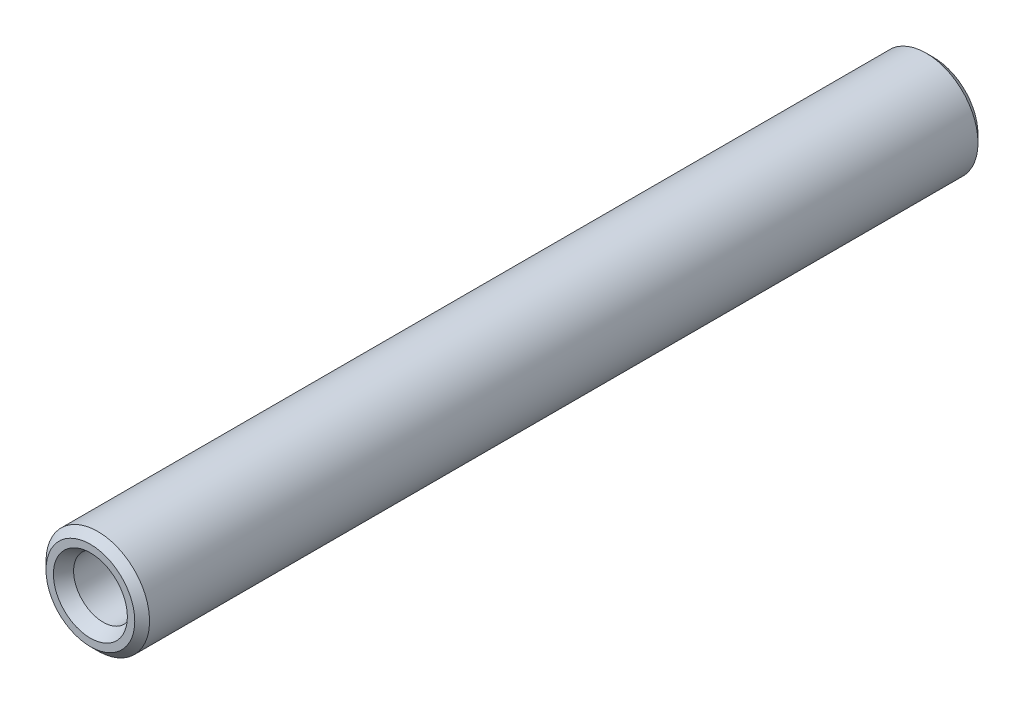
ISO-10303-21;
HEADER;
FILE_DESCRIPTION(('STEP AP214'),'2;1');
FILE_NAME('part.step','',(''),(''),'','','');
FILE_SCHEMA(('AUTOMOTIVE_DESIGN { 1 0 10303 214 1 1 1 1 }'));
ENDSEC;
DATA;
#1=APPLICATION_CONTEXT('core data for automotive mechanical design processes');
#2=APPLICATION_PROTOCOL_DEFINITION('international standard','automotive_design',2000,#1);
#3=PRODUCT_CONTEXT('',#1,'mechanical');
#4=PRODUCT('Part','Part','',(#3));
#5=PRODUCT_RELATED_PRODUCT_CATEGORY('part','',(#4));
#6=PRODUCT_DEFINITION_FORMATION('','',#4);
#7=PRODUCT_DEFINITION_CONTEXT('part definition',#1,'design');
#8=PRODUCT_DEFINITION('design','',#6,#7);
#9=PRODUCT_DEFINITION_SHAPE('','',#8);
#10=(LENGTH_UNIT() NAMED_UNIT(*) SI_UNIT(.MILLI.,.METRE.));
#11=(NAMED_UNIT(*) PLANE_ANGLE_UNIT() SI_UNIT($,.RADIAN.));
#12=(NAMED_UNIT(*) SI_UNIT($,.STERADIAN.) SOLID_ANGLE_UNIT());
#13=UNCERTAINTY_MEASURE_WITH_UNIT(LENGTH_MEASURE(1.E-05),#10,'distance_accuracy_value','');
#14=(GEOMETRIC_REPRESENTATION_CONTEXT(3) GLOBAL_UNCERTAINTY_ASSIGNED_CONTEXT((#13)) GLOBAL_UNIT_ASSIGNED_CONTEXT((#10,
#11,#12)) REPRESENTATION_CONTEXT('',''));
#15=CARTESIAN_POINT('',(0.,0.,0.));
#16=DIRECTION('',(0.,0.,1.));
#17=DIRECTION('',(1.,0.,0.));
#18=AXIS2_PLACEMENT_3D('',#15,#16,#17);
#19=CARTESIAN_POINT('',(0.,0.,114.));
#20=DIRECTION('',(0.,0.,-1.));
#21=DIRECTION('',(-1.,0.,0.));
#22=AXIS2_PLACEMENT_3D('',#19,#20,#21);
#23=CYLINDRICAL_SURFACE('',#22,7.);
#24=CARTESIAN_POINT('',(0.,0.,1.00000000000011));
#25=DIRECTION('',(0.,0.,1.));
#26=DIRECTION('',(1.,0.,0.));
#27=AXIS2_PLACEMENT_3D('',#24,#25,#26);
#28=CIRCLE('',#27,7.);
#29=CARTESIAN_POINT('',(-7.,0.,1.00000000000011));
#30=VERTEX_POINT('',#29);
#31=EDGE_CURVE('E74',#30,#30,#28,.T.);
#32=CARTESIAN_POINT('',(0.,0.,113.));
#33=DIRECTION('',(0.,0.,1.));
#34=DIRECTION('',(1.,0.,0.));
#35=AXIS2_PLACEMENT_3D('',#32,#33,#34);
#36=CIRCLE('',#35,7.);
#37=CARTESIAN_POINT('',(-7.,0.,113.));
#38=VERTEX_POINT('',#37);
#39=EDGE_CURVE('E78',#38,#38,#36,.F.);
#40=CARTESIAN_POINT('',(-7.,0.,1.00000000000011));
#41=CARTESIAN_POINT('',(-7.,0.,2.16666666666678));
#42=CARTESIAN_POINT('',(-7.,0.,3.33333333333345));
#43=CARTESIAN_POINT('',(-7.,0.,5.66666666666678));
#44=CARTESIAN_POINT('',(-7.,0.,6.83333333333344));
#45=CARTESIAN_POINT('',(-7.,0.,9.16666666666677));
#46=CARTESIAN_POINT('',(-7.,0.,10.3333333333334));
#47=CARTESIAN_POINT('',(-7.,0.,12.6666666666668));
#48=CARTESIAN_POINT('',(-7.,0.,13.8333333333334));
#49=CARTESIAN_POINT('',(-7.,0.,16.1666666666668));
#50=CARTESIAN_POINT('',(-7.,0.,17.3333333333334));
#51=CARTESIAN_POINT('',(-7.,0.,19.6666666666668));
#52=CARTESIAN_POINT('',(-7.,0.,20.8333333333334));
#53=CARTESIAN_POINT('',(-7.,0.,23.1666666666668));
#54=CARTESIAN_POINT('',(-7.,0.,24.3333333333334));
#55=CARTESIAN_POINT('',(-7.,0.,26.6666666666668));
#56=CARTESIAN_POINT('',(-7.,0.,27.8333333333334));
#57=CARTESIAN_POINT('',(-7.,0.,30.1666666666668));
#58=CARTESIAN_POINT('',(-7.,0.,31.3333333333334));
#59=CARTESIAN_POINT('',(-7.,0.,33.6666666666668));
#60=CARTESIAN_POINT('',(-7.,0.,34.8333333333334));
#61=CARTESIAN_POINT('',(-7.,0.,37.1666666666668));
#62=CARTESIAN_POINT('',(-7.,0.,38.3333333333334));
#63=CARTESIAN_POINT('',(-7.,0.,40.6666666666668));
#64=CARTESIAN_POINT('',(-7.,0.,41.8333333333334));
#65=CARTESIAN_POINT('',(-7.,0.,44.1666666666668));
#66=CARTESIAN_POINT('',(-7.,0.,45.3333333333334));
#67=CARTESIAN_POINT('',(-7.,0.,47.6666666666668));
#68=CARTESIAN_POINT('',(-7.,0.,48.8333333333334));
#69=CARTESIAN_POINT('',(-7.,0.,51.1666666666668));
#70=CARTESIAN_POINT('',(-7.,0.,52.3333333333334));
#71=CARTESIAN_POINT('',(-7.,0.,54.6666666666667));
#72=CARTESIAN_POINT('',(-7.,0.,55.8333333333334));
#73=CARTESIAN_POINT('',(-7.,0.,58.1666666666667));
#74=CARTESIAN_POINT('',(-7.,0.,59.3333333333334));
#75=CARTESIAN_POINT('',(-7.,0.,61.6666666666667));
#76=CARTESIAN_POINT('',(-7.,0.,62.8333333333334));
#77=CARTESIAN_POINT('',(-7.,0.,65.1666666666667));
#78=CARTESIAN_POINT('',(-7.,0.,66.3333333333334));
#79=CARTESIAN_POINT('',(-7.,0.,68.6666666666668));
#80=CARTESIAN_POINT('',(-7.,0.,69.8333333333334));
#81=CARTESIAN_POINT('',(-7.,0.,72.1666666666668));
#82=CARTESIAN_POINT('',(-7.,0.,73.3333333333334));
#83=CARTESIAN_POINT('',(-7.,0.,75.6666666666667));
#84=CARTESIAN_POINT('',(-7.,0.,76.8333333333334));
#85=CARTESIAN_POINT('',(-7.,0.,79.1666666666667));
#86=CARTESIAN_POINT('',(-7.,0.,80.3333333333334));
#87=CARTESIAN_POINT('',(-7.,0.,82.6666666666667));
#88=CARTESIAN_POINT('',(-7.,0.,83.8333333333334));
#89=CARTESIAN_POINT('',(-7.,0.,86.1666666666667));
#90=CARTESIAN_POINT('',(-7.,0.,87.3333333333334));
#91=CARTESIAN_POINT('',(-7.,0.,89.6666666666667));
#92=CARTESIAN_POINT('',(-7.,0.,90.8333333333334));
#93=CARTESIAN_POINT('',(-7.,0.,93.1666666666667));
#94=CARTESIAN_POINT('',(-7.,0.,94.3333333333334));
#95=CARTESIAN_POINT('',(-7.,0.,96.6666666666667));
#96=CARTESIAN_POINT('',(-7.,0.,97.8333333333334));
#97=CARTESIAN_POINT('',(-7.,0.,100.166666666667));
#98=CARTESIAN_POINT('',(-7.,0.,101.333333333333));
#99=CARTESIAN_POINT('',(-7.,0.,103.666666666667));
#100=CARTESIAN_POINT('',(-7.,0.,104.833333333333));
#101=CARTESIAN_POINT('',(-7.,0.,107.166666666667));
#102=CARTESIAN_POINT('',(-7.,0.,108.333333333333));
#103=CARTESIAN_POINT('',(-7.,0.,110.666666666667));
#104=CARTESIAN_POINT('',(-7.,0.,111.833333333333));
#105=CARTESIAN_POINT('',(-7.,0.,113.));
#106=B_SPLINE_CURVE_WITH_KNOTS('',3,(#40,#41,#42,#43,#44,#45,#46,#47,#48,#49,#50,#51,#52,#53,
#54,#55,#56,#57,#58,#59,#60,#61,#62,#63,#64,#65,#66,#67,#68,#69,#70,#71,#72,#73,#74,#75,#76,#77,
#78,#79,#80,#81,#82,#83,#84,#85,#86,#87,#88,#89,#90,#91,#92,#93,#94,#95,#96,#97,#98,#99,#100,
#101,#102,#103,#104,#105),.UNSPECIFIED.,.F.,.F.,(4,2,2,2,2,2,2,2,2,2,2,2,2,2,2,2,2,2,2,2,2,2,2,
2,2,2,2,2,2,2,2,2,4),(0.,3.5,6.99999999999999,10.5,14.,17.5,21.,24.5,28.,31.5,35.,38.5,42.,45.5,
49.,52.5,56.,59.5,63.,66.5,70.,73.5,77.,80.5,83.9999999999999,87.5,91.,94.5,97.9999999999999,
101.5,105.,108.5,112.),.UNSPECIFIED.);
#107=EDGE_CURVE('BSEAM41',#30,#38,#106,.T.);
#108=ORIENTED_EDGE('',*,*,#31,.T.);
#109=ORIENTED_EDGE('',*,*,#39,.T.);
#110=ORIENTED_EDGE('',*,*,#107,.T.);
#111=ORIENTED_EDGE('',*,*,#107,.F.);
#112=EDGE_LOOP('',(#108,#110,#109,#111));
#113=FACE_BOUND('',#112,.T.);
#114=ADVANCED_FACE('F41',(#113),#23,.T.);
#115=CARTESIAN_POINT('',(0.,0.,114.));
#116=DIRECTION('',(0.,0.,1.));
#117=DIRECTION('',(1.,0.,0.));
#118=AXIS2_PLACEMENT_3D('',#115,#116,#117);
#119=PLANE('',#118);
#120=CARTESIAN_POINT('',(0.,0.,114.));
#121=DIRECTION('',(0.,0.,1.));
#122=DIRECTION('',(1.,0.,0.));
#123=AXIS2_PLACEMENT_3D('',#120,#121,#122);
#124=CIRCLE('',#123,5.00000000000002);
#125=CARTESIAN_POINT('',(5.00000000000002,0.,114.));
#126=VERTEX_POINT('',#125);
#127=EDGE_CURVE('E55',#126,#126,#124,.F.);
#128=ORIENTED_EDGE('',*,*,#127,.T.);
#129=EDGE_LOOP('',(#128));
#130=FACE_BOUND('',#129,.T.);
#131=CARTESIAN_POINT('',(0.,0.,114.));
#132=DIRECTION('',(0.,0.,1.));
#133=DIRECTION('',(1.,0.,0.));
#134=AXIS2_PLACEMENT_3D('',#131,#132,#133);
#135=CIRCLE('',#134,6.00000000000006);
#136=CARTESIAN_POINT('',(6.00000000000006,0.,114.));
#137=VERTEX_POINT('',#136);
#138=EDGE_CURVE('E66',#137,#137,#135,.T.);
#139=ORIENTED_EDGE('',*,*,#138,.T.);
#140=EDGE_LOOP('',(#139));
#141=FACE_BOUND('',#140,.T.);
#142=ADVANCED_FACE('F107',(#130,#141),#119,.T.);
#143=CARTESIAN_POINT('',(0.,0.,0.));
#144=DIRECTION('',(0.,0.,1.));
#145=DIRECTION('',(1.,0.,0.));
#146=AXIS2_PLACEMENT_3D('',#143,#144,#145);
#147=PLANE('',#146);
#148=CARTESIAN_POINT('',(0.,0.,0.));
#149=DIRECTION('',(0.,0.,1.));
#150=DIRECTION('',(1.,0.,0.));
#151=AXIS2_PLACEMENT_3D('',#148,#149,#150);
#152=CIRCLE('',#151,4.99999999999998);
#153=CARTESIAN_POINT('',(4.99999999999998,0.,0.));
#154=VERTEX_POINT('',#153);
#155=EDGE_CURVE('E10',#154,#154,#152,.T.);
#156=ORIENTED_EDGE('',*,*,#155,.T.);
#157=EDGE_LOOP('',(#156));
#158=FACE_BOUND('',#157,.T.);
#159=CARTESIAN_POINT('',(0.,0.,0.));
#160=DIRECTION('',(0.,0.,1.));
#161=DIRECTION('',(1.,0.,0.));
#162=AXIS2_PLACEMENT_3D('',#159,#160,#161);
#163=CIRCLE('',#162,5.99999999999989);
#164=CARTESIAN_POINT('',(5.99999999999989,0.,0.));
#165=VERTEX_POINT('',#164);
#166=EDGE_CURVE('E70',#165,#165,#163,.F.);
#167=ORIENTED_EDGE('',*,*,#166,.T.);
#168=EDGE_LOOP('',(#167));
#169=FACE_BOUND('',#168,.T.);
#170=ADVANCED_FACE('F113',(#158,#169),#147,.F.);
#171=CARTESIAN_POINT('',(0.,0.,99.));
#172=DIRECTION('',(0.,0.,1.));
#173=DIRECTION('',(1.,0.,0.));
#174=AXIS2_PLACEMENT_3D('',#171,#172,#173);
#175=CYLINDRICAL_SURFACE('',#174,4.);
#176=CARTESIAN_POINT('',(0.,0.,112.267949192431));
#177=DIRECTION('',(0.,0.,1.));
#178=DIRECTION('',(1.,0.,0.));
#179=AXIS2_PLACEMENT_3D('',#176,#177,#178);
#180=CIRCLE('',#179,4.);
#181=CARTESIAN_POINT('',(4.,0.,112.267949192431));
#182=VERTEX_POINT('',#181);
#183=EDGE_CURVE('E60',#182,#182,#180,.T.);
#184=ORIENTED_EDGE('',*,*,#183,.T.);
#185=EDGE_LOOP('',(#184));
#186=FACE_BOUND('',#185,.T.);
#187=CARTESIAN_POINT('',(0.,0.,99.));
#188=DIRECTION('',(0.,0.,1.));
#189=DIRECTION('',(1.,0.,0.));
#190=AXIS2_PLACEMENT_3D('',#187,#188,#189);
#191=CIRCLE('',#190,4.);
#192=CARTESIAN_POINT('',(4.,0.,99.));
#193=VERTEX_POINT('',#192);
#194=EDGE_CURVE('E82',#193,#193,#191,.T.);
#195=ORIENTED_EDGE('',*,*,#194,.F.);
#196=EDGE_LOOP('',(#195));
#197=FACE_BOUND('',#196,.T.);
#198=ADVANCED_FACE('F103',(#186,#197),#175,.F.);
#199=CARTESIAN_POINT('',(0.,0.,99.));
#200=DIRECTION('',(0.,0.,1.));
#201=DIRECTION('',(1.,0.,0.));
#202=AXIS2_PLACEMENT_3D('',#199,#200,#201);
#203=PLANE('',#202);
#204=ORIENTED_EDGE('',*,*,#194,.T.);
#205=EDGE_LOOP('',(#204));
#206=FACE_BOUND('',#205,.T.);
#207=ADVANCED_FACE('F95',(#206),#203,.T.);
#208=CARTESIAN_POINT('',(0.,0.,15.));
#209=DIRECTION('',(0.,0.,-1.));
#210=DIRECTION('',(-1.,0.,0.));
#211=AXIS2_PLACEMENT_3D('',#208,#209,#210);
#212=CYLINDRICAL_SURFACE('',#211,4.);
#213=CARTESIAN_POINT('',(0.,0.,1.73205080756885));
#214=DIRECTION('',(0.,0.,1.));
#215=DIRECTION('',(1.,0.,0.));
#216=AXIS2_PLACEMENT_3D('',#213,#214,#215);
#217=CIRCLE('',#216,4.);
#218=CARTESIAN_POINT('',(4.,0.,1.73205080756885));
#219=VERTEX_POINT('',#218);
#220=EDGE_CURVE('E50',#219,#219,#217,.F.);
#221=ORIENTED_EDGE('',*,*,#220,.T.);
#222=EDGE_LOOP('',(#221));
#223=FACE_BOUND('',#222,.T.);
#224=CARTESIAN_POINT('',(0.,0.,15.));
#225=DIRECTION('',(0.,0.,-1.));
#226=DIRECTION('',(-1.,0.,0.));
#227=AXIS2_PLACEMENT_3D('',#224,#225,#226);
#228=CIRCLE('',#227,4.);
#229=CARTESIAN_POINT('',(-4.,0.,15.));
#230=VERTEX_POINT('',#229);
#231=EDGE_CURVE('E86',#230,#230,#228,.T.);
#232=ORIENTED_EDGE('',*,*,#231,.F.);
#233=EDGE_LOOP('',(#232));
#234=FACE_BOUND('',#233,.T.);
#235=ADVANCED_FACE('F93',(#223,#234),#212,.F.);
#236=CARTESIAN_POINT('',(0.,0.,15.));
#237=DIRECTION('',(0.,0.,-1.));
#238=DIRECTION('',(-1.,0.,0.));
#239=AXIS2_PLACEMENT_3D('',#236,#237,#238);
#240=PLANE('',#239);
#241=ORIENTED_EDGE('',*,*,#231,.T.);
#242=EDGE_LOOP('',(#241));
#243=FACE_BOUND('',#242,.T.);
#244=ADVANCED_FACE('F91',(#243),#240,.T.);
#245=CARTESIAN_POINT('',(0.,0.,1.00000000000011));
#246=DIRECTION('',(0.,0.,1.));
#247=DIRECTION('',(1.,0.,0.));
#248=AXIS2_PLACEMENT_3D('',#245,#246,#247);
#249=CONICAL_SURFACE('',#248,7.,0.785398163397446);
#250=ORIENTED_EDGE('',*,*,#166,.F.);
#251=EDGE_LOOP('',(#250));
#252=FACE_BOUND('',#251,.T.);
#253=ORIENTED_EDGE('',*,*,#31,.F.);
#254=EDGE_LOOP('',(#253));
#255=FACE_BOUND('',#254,.T.);
#256=ADVANCED_FACE('F101',(#252,#255),#249,.T.);
#257=CARTESIAN_POINT('',(0.,0.,114.));
#258=DIRECTION('',(0.,0.,-1.));
#259=DIRECTION('',(-1.,0.,0.));
#260=AXIS2_PLACEMENT_3D('',#257,#258,#259);
#261=CONICAL_SURFACE('',#260,6.00000000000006,0.785398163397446);
#262=ORIENTED_EDGE('',*,*,#39,.F.);
#263=EDGE_LOOP('',(#262));
#264=FACE_BOUND('',#263,.T.);
#265=ORIENTED_EDGE('',*,*,#138,.F.);
#266=EDGE_LOOP('',(#265));
#267=FACE_BOUND('',#266,.T.);
#268=ADVANCED_FACE('F125',(#264,#267),#261,.T.);
#269=CARTESIAN_POINT('',(0.,0.,112.267949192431));
#270=DIRECTION('',(0.,0.,1.));
#271=DIRECTION('',(1.,0.,0.));
#272=AXIS2_PLACEMENT_3D('',#269,#270,#271);
#273=CONICAL_SURFACE('',#272,4.,0.523598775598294);
#274=ORIENTED_EDGE('',*,*,#127,.F.);
#275=EDGE_LOOP('',(#274));
#276=FACE_BOUND('',#275,.T.);
#277=ORIENTED_EDGE('',*,*,#183,.F.);
#278=EDGE_LOOP('',(#277));
#279=FACE_BOUND('',#278,.T.);
#280=ADVANCED_FACE('F131',(#276,#279),#273,.F.);
#281=CARTESIAN_POINT('',(0.,0.,1.73205080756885));
#282=DIRECTION('',(0.,0.,-1.));
#283=DIRECTION('',(-1.,0.,0.));
#284=AXIS2_PLACEMENT_3D('',#281,#282,#283);
#285=CONICAL_SURFACE('',#284,4.,0.523598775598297);
#286=ORIENTED_EDGE('',*,*,#155,.F.);
#287=EDGE_LOOP('',(#286));
#288=FACE_BOUND('',#287,.T.);
#289=ORIENTED_EDGE('',*,*,#220,.F.);
#290=EDGE_LOOP('',(#289));
#291=FACE_BOUND('',#290,.T.);
#292=ADVANCED_FACE('F44',(#288,#291),#285,.F.);
#293=CLOSED_SHELL('',(#114,#142,#170,#198,#207,#235,#244,#256,#268,#280,#292));
#294=MANIFOLD_SOLID_BREP('B2',#293);
#295=ADVANCED_BREP_SHAPE_REPRESENTATION('',(#18,#294),#14);
#296=SHAPE_DEFINITION_REPRESENTATION(#9,#295);
ENDSEC;
END-ISO-10303-21;
